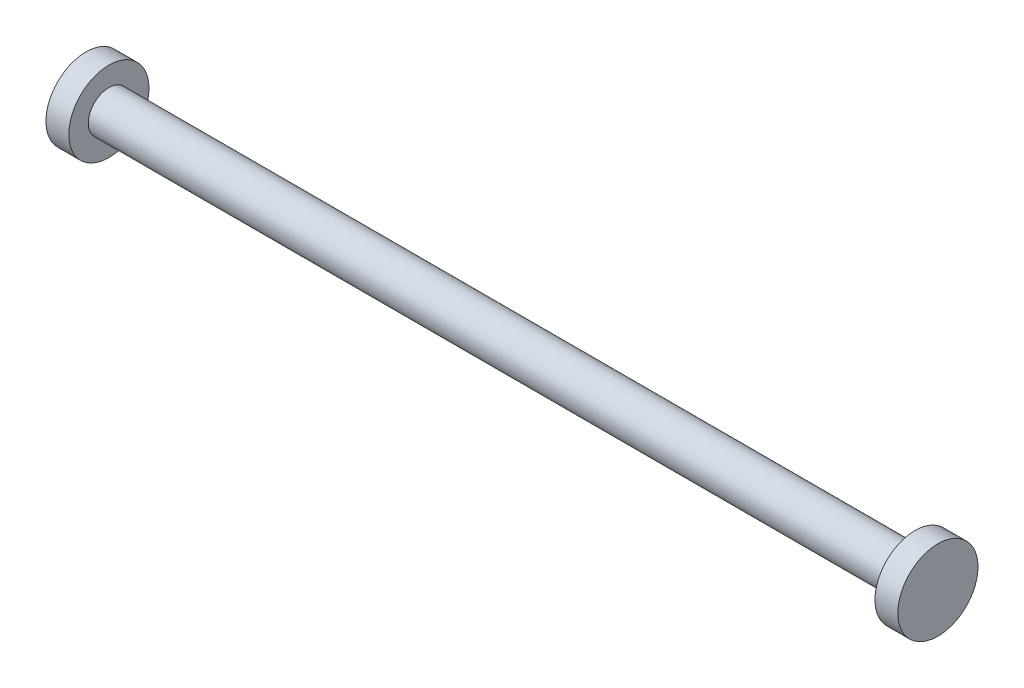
ISO-10303-21;
HEADER;
FILE_DESCRIPTION(('STEP AP214'),'2;1');
FILE_NAME('part.step','',(''),(''),'','','');
FILE_SCHEMA(('AUTOMOTIVE_DESIGN { 1 0 10303 214 1 1 1 1 }'));
ENDSEC;
DATA;
#1=APPLICATION_CONTEXT('core data for automotive mechanical design processes');
#2=APPLICATION_PROTOCOL_DEFINITION('international standard','automotive_design',2000,#1);
#3=PRODUCT_CONTEXT('',#1,'mechanical');
#4=PRODUCT('Part','Part','',(#3));
#5=PRODUCT_RELATED_PRODUCT_CATEGORY('part','',(#4));
#6=PRODUCT_DEFINITION_FORMATION('','',#4);
#7=PRODUCT_DEFINITION_CONTEXT('part definition',#1,'design');
#8=PRODUCT_DEFINITION('design','',#6,#7);
#9=PRODUCT_DEFINITION_SHAPE('','',#8);
#10=(LENGTH_UNIT() NAMED_UNIT(*) SI_UNIT(.MILLI.,.METRE.));
#11=(NAMED_UNIT(*) PLANE_ANGLE_UNIT() SI_UNIT($,.RADIAN.));
#12=(NAMED_UNIT(*) SI_UNIT($,.STERADIAN.) SOLID_ANGLE_UNIT());
#13=UNCERTAINTY_MEASURE_WITH_UNIT(LENGTH_MEASURE(1.E-05),#10,'distance_accuracy_value','');
#14=(GEOMETRIC_REPRESENTATION_CONTEXT(3) GLOBAL_UNCERTAINTY_ASSIGNED_CONTEXT((#13)) GLOBAL_UNIT_ASSIGNED_CONTEXT((#10,
#11,#12)) REPRESENTATION_CONTEXT('',''));
#15=CARTESIAN_POINT('',(0.,0.,0.));
#16=DIRECTION('',(0.,0.,1.));
#17=DIRECTION('',(1.,0.,0.));
#18=AXIS2_PLACEMENT_3D('',#15,#16,#17);
#19=CARTESIAN_POINT('',(-40.4911688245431,-3.85,2.25));
#20=DIRECTION('',(1.,0.,0.));
#21=DIRECTION('',(0.,0.,-1.));
#22=AXIS2_PLACEMENT_3D('',#19,#20,#21);
#23=CYLINDRICAL_SURFACE('',#22,1.8);
#24=CARTESIAN_POINT('',(-35.2,-3.85,2.25));
#25=DIRECTION('',(1.,0.,0.));
#26=DIRECTION('',(0.,0.,-1.));
#27=AXIS2_PLACEMENT_3D('',#24,#25,#26);
#28=CIRCLE('',#27,1.8);
#29=CARTESIAN_POINT('',(-35.2,-3.85,0.449999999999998));
#30=VERTEX_POINT('',#29);
#31=EDGE_CURVE('E10',#30,#30,#28,.F.);
#32=ORIENTED_EDGE('',*,*,#31,.F.);
#33=EDGE_LOOP('',(#32));
#34=FACE_BOUND('',#33,.T.);
#35=CARTESIAN_POINT('',(35.2,-3.85,2.25));
#36=DIRECTION('',(1.,0.,0.));
#37=DIRECTION('',(0.,0.,-1.));
#38=AXIS2_PLACEMENT_3D('',#35,#36,#37);
#39=CIRCLE('',#38,1.8);
#40=CARTESIAN_POINT('',(35.2,-3.85,0.449999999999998));
#41=VERTEX_POINT('',#40);
#42=EDGE_CURVE('E36',#41,#41,#39,.T.);
#43=ORIENTED_EDGE('',*,*,#42,.F.);
#44=EDGE_LOOP('',(#43));
#45=FACE_BOUND('',#44,.T.);
#46=ADVANCED_FACE('F30',(#34,#45),#23,.T.);
#47=CARTESIAN_POINT('',(37.2,-3.85,2.25));
#48=DIRECTION('',(-1.,0.,0.));
#49=DIRECTION('',(0.,0.,1.));
#50=AXIS2_PLACEMENT_3D('',#47,#48,#49);
#51=CYLINDRICAL_SURFACE('',#50,3.5);
#52=CARTESIAN_POINT('',(37.2,-3.85,2.25));
#53=DIRECTION('',(1.,0.,0.));
#54=DIRECTION('',(0.,0.,-1.));
#55=AXIS2_PLACEMENT_3D('',#52,#53,#54);
#56=CIRCLE('',#55,3.5);
#57=CARTESIAN_POINT('',(37.2,-3.85,-1.25));
#58=VERTEX_POINT('',#57);
#59=EDGE_CURVE('E40',#58,#58,#56,.T.);
#60=ORIENTED_EDGE('',*,*,#59,.F.);
#61=EDGE_LOOP('',(#60));
#62=FACE_BOUND('',#61,.T.);
#63=CARTESIAN_POINT('',(35.2,-3.85,2.25));
#64=DIRECTION('',(1.,0.,0.));
#65=DIRECTION('',(0.,0.,-1.));
#66=AXIS2_PLACEMENT_3D('',#63,#64,#65);
#67=CIRCLE('',#66,3.5);
#68=CARTESIAN_POINT('',(35.2,-3.85,-1.25));
#69=VERTEX_POINT('',#68);
#70=EDGE_CURVE('E44',#69,#69,#67,.T.);
#71=ORIENTED_EDGE('',*,*,#70,.T.);
#72=EDGE_LOOP('',(#71));
#73=FACE_BOUND('',#72,.T.);
#74=ADVANCED_FACE('F71',(#62,#73),#51,.T.);
#75=CARTESIAN_POINT('',(37.2,-3.85,2.25));
#76=DIRECTION('',(1.,0.,0.));
#77=DIRECTION('',(0.,0.,-1.));
#78=AXIS2_PLACEMENT_3D('',#75,#76,#77);
#79=PLANE('',#78);
#80=ORIENTED_EDGE('',*,*,#59,.T.);
#81=EDGE_LOOP('',(#80));
#82=FACE_BOUND('',#81,.T.);
#83=ADVANCED_FACE('F76',(#82),#79,.T.);
#84=CARTESIAN_POINT('',(35.2,-3.85,2.25));
#85=DIRECTION('',(1.,0.,0.));
#86=DIRECTION('',(0.,0.,-1.));
#87=AXIS2_PLACEMENT_3D('',#84,#85,#86);
#88=PLANE('',#87);
#89=ORIENTED_EDGE('',*,*,#42,.T.);
#90=EDGE_LOOP('',(#89));
#91=FACE_BOUND('',#90,.T.);
#92=ORIENTED_EDGE('',*,*,#70,.F.);
#93=EDGE_LOOP('',(#92));
#94=FACE_BOUND('',#93,.T.);
#95=ADVANCED_FACE('F68',(#91,#94),#88,.F.);
#96=CARTESIAN_POINT('',(-37.2,-3.85,2.25));
#97=DIRECTION('',(1.,0.,0.));
#98=DIRECTION('',(0.,0.,-1.));
#99=AXIS2_PLACEMENT_3D('',#96,#97,#98);
#100=CYLINDRICAL_SURFACE('',#99,3.5);
#101=CARTESIAN_POINT('',(-37.2,-3.85,2.25));
#102=DIRECTION('',(1.,0.,0.));
#103=DIRECTION('',(0.,0.,-1.));
#104=AXIS2_PLACEMENT_3D('',#101,#102,#103);
#105=CIRCLE('',#104,3.5);
#106=CARTESIAN_POINT('',(-37.2,-3.85,-1.25));
#107=VERTEX_POINT('',#106);
#108=EDGE_CURVE('E48',#107,#107,#105,.T.);
#109=ORIENTED_EDGE('',*,*,#108,.T.);
#110=EDGE_LOOP('',(#109));
#111=FACE_BOUND('',#110,.T.);
#112=CARTESIAN_POINT('',(-35.2,-3.85,2.25));
#113=DIRECTION('',(1.,0.,0.));
#114=DIRECTION('',(0.,0.,-1.));
#115=AXIS2_PLACEMENT_3D('',#112,#113,#114);
#116=CIRCLE('',#115,3.5);
#117=CARTESIAN_POINT('',(-35.2,-3.85,-1.25));
#118=VERTEX_POINT('',#117);
#119=EDGE_CURVE('E50',#118,#118,#116,.T.);
#120=ORIENTED_EDGE('',*,*,#119,.F.);
#121=EDGE_LOOP('',(#120));
#122=FACE_BOUND('',#121,.T.);
#123=ADVANCED_FACE('F56',(#111,#122),#100,.T.);
#124=CARTESIAN_POINT('',(-37.2,-3.85,2.25));
#125=DIRECTION('',(-1.,0.,0.));
#126=DIRECTION('',(0.,0.,-1.));
#127=AXIS2_PLACEMENT_3D('',#124,#125,#126);
#128=PLANE('',#127);
#129=ORIENTED_EDGE('',*,*,#108,.F.);
#130=EDGE_LOOP('',(#129));
#131=FACE_BOUND('',#130,.T.);
#132=ADVANCED_FACE('F59',(#131),#128,.T.);
#133=CARTESIAN_POINT('',(-35.2,-3.85,2.25));
#134=DIRECTION('',(-1.,0.,0.));
#135=DIRECTION('',(0.,0.,-1.));
#136=AXIS2_PLACEMENT_3D('',#133,#134,#135);
#137=PLANE('',#136);
#138=ORIENTED_EDGE('',*,*,#31,.T.);
#139=EDGE_LOOP('',(#138));
#140=FACE_BOUND('',#139,.T.);
#141=ORIENTED_EDGE('',*,*,#119,.T.);
#142=EDGE_LOOP('',(#141));
#143=FACE_BOUND('',#142,.T.);
#144=ADVANCED_FACE('F61',(#140,#143),#137,.F.);
#145=CLOSED_SHELL('',(#46,#74,#83,#95,#123,#132,#144));
#146=MANIFOLD_SOLID_BREP('B2',#145);
#147=ADVANCED_BREP_SHAPE_REPRESENTATION('',(#18,#146),#14);
#148=SHAPE_DEFINITION_REPRESENTATION(#9,#147);
ENDSEC;
END-ISO-10303-21;
